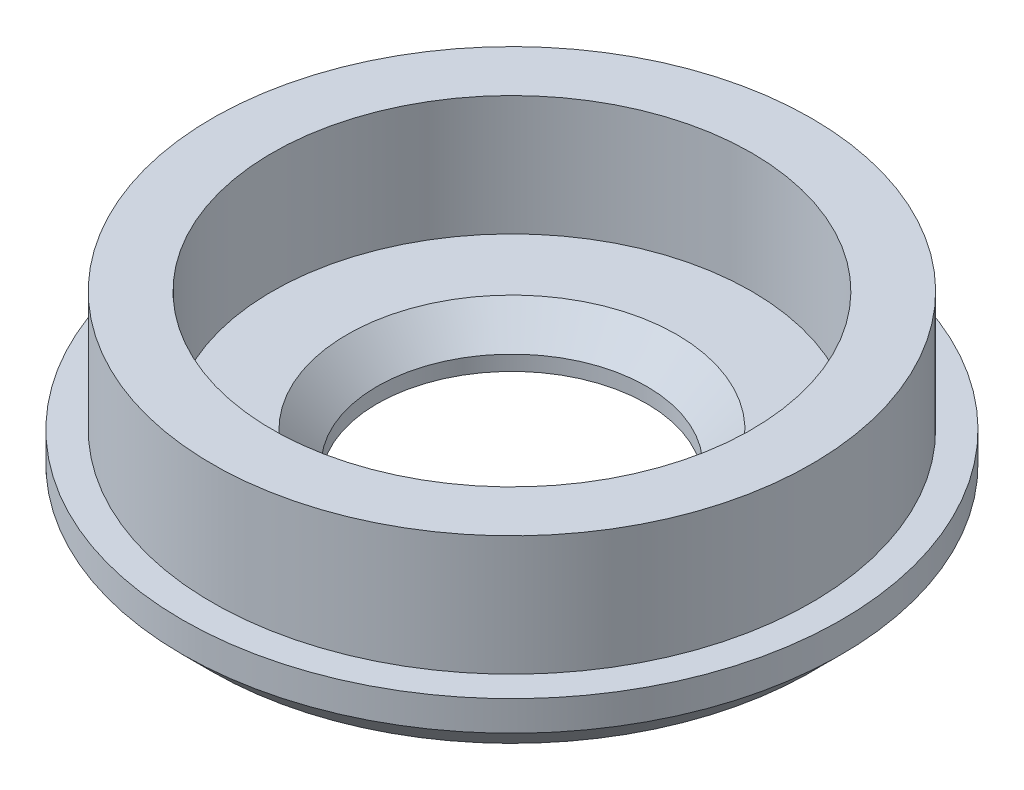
ISO-10303-21;
HEADER;
FILE_DESCRIPTION(('STEP AP214'),'2;1');
FILE_NAME('part.step','',(''),(''),'','','');
FILE_SCHEMA(('AUTOMOTIVE_DESIGN { 1 0 10303 214 1 1 1 1 }'));
ENDSEC;
DATA;
#1=APPLICATION_CONTEXT('core data for automotive mechanical design processes');
#2=APPLICATION_PROTOCOL_DEFINITION('international standard','automotive_design',2000,#1);
#3=PRODUCT_CONTEXT('',#1,'mechanical');
#4=PRODUCT('Part','Part','',(#3));
#5=PRODUCT_RELATED_PRODUCT_CATEGORY('part','',(#4));
#6=PRODUCT_DEFINITION_FORMATION('','',#4);
#7=PRODUCT_DEFINITION_CONTEXT('part definition',#1,'design');
#8=PRODUCT_DEFINITION('design','',#6,#7);
#9=PRODUCT_DEFINITION_SHAPE('','',#8);
#10=(LENGTH_UNIT() NAMED_UNIT(*) SI_UNIT(.MILLI.,.METRE.));
#11=(NAMED_UNIT(*) PLANE_ANGLE_UNIT() SI_UNIT($,.RADIAN.));
#12=(NAMED_UNIT(*) SI_UNIT($,.STERADIAN.) SOLID_ANGLE_UNIT());
#13=UNCERTAINTY_MEASURE_WITH_UNIT(LENGTH_MEASURE(1.E-05),#10,'distance_accuracy_value','');
#14=(GEOMETRIC_REPRESENTATION_CONTEXT(3) GLOBAL_UNCERTAINTY_ASSIGNED_CONTEXT((#13)) GLOBAL_UNIT_ASSIGNED_CONTEXT((#10,
#11,#12)) REPRESENTATION_CONTEXT('',''));
#15=CARTESIAN_POINT('',(0.,0.,0.));
#16=DIRECTION('',(0.,0.,1.));
#17=DIRECTION('',(1.,0.,0.));
#18=AXIS2_PLACEMENT_3D('',#15,#16,#17);
#19=CARTESIAN_POINT('',(0.,0.,0.));
#20=DIRECTION('',(0.,1.,0.));
#21=DIRECTION('',(0.,0.,1.));
#22=AXIS2_PLACEMENT_3D('',#19,#20,#21);
#23=PLANE('',#22);
#24=CARTESIAN_POINT('',(0.,0.,0.));
#25=DIRECTION('',(0.,-1.,0.));
#26=DIRECTION('',(0.,0.,-1.));
#27=AXIS2_PLACEMENT_3D('',#24,#25,#26);
#28=CIRCLE('',#27,8.);
#29=CARTESIAN_POINT('',(0.,0.,-8.));
#30=VERTEX_POINT('',#29);
#31=EDGE_CURVE('E151',#30,#30,#28,.F.);
#32=ORIENTED_EDGE('',*,*,#31,.T.);
#33=EDGE_LOOP('',(#32));
#34=FACE_BOUND('',#33,.T.);
#35=CARTESIAN_POINT('',(0.,5.6843418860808E-11,0.));
#36=DIRECTION('',(0.,1.,0.));
#37=DIRECTION('',(0.,0.,1.));
#38=AXIS2_PLACEMENT_3D('',#35,#36,#37);
#39=CIRCLE('',#38,5.49999999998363);
#40=CARTESIAN_POINT('',(0.,5.6843418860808E-11,5.49999999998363));
#41=VERTEX_POINT('',#40);
#42=EDGE_CURVE('E154',#41,#41,#39,.F.);
#43=ORIENTED_EDGE('',*,*,#42,.T.);
#44=EDGE_LOOP('',(#43));
#45=FACE_BOUND('',#44,.T.);
#46=ADVANCED_FACE('F17',(#34,#45),#23,.T.);
#47=CARTESIAN_POINT('',(0.,4.,0.));
#48=DIRECTION('',(0.,-1.,0.));
#49=DIRECTION('',(0.,0.,-1.));
#50=AXIS2_PLACEMENT_3D('',#47,#48,#49);
#51=CYLINDRICAL_SURFACE('',#50,8.);
#52=CARTESIAN_POINT('',(0.,4.,0.));
#53=DIRECTION('',(0.,-1.,0.));
#54=DIRECTION('',(0.,0.,-1.));
#55=AXIS2_PLACEMENT_3D('',#52,#53,#54);
#56=CIRCLE('',#55,8.);
#57=CARTESIAN_POINT('',(0.,4.,-8.));
#58=VERTEX_POINT('',#57);
#59=EDGE_CURVE('E157',#58,#58,#56,.T.);
#60=ORIENTED_EDGE('',*,*,#59,.F.);
#61=EDGE_LOOP('',(#60));
#62=FACE_BOUND('',#61,.T.);
#63=ORIENTED_EDGE('',*,*,#31,.F.);
#64=EDGE_LOOP('',(#63));
#65=FACE_BOUND('',#64,.T.);
#66=ADVANCED_FACE('F90',(#62,#65),#51,.F.);
#67=CARTESIAN_POINT('',(0.,5.6843418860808E-11,0.));
#68=DIRECTION('',(0.,1.,0.));
#69=DIRECTION('',(0.,0.,1.));
#70=AXIS2_PLACEMENT_3D('',#67,#68,#69);
#71=CONICAL_SURFACE('',#70,5.49999999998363,0.785398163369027);
#72=ORIENTED_EDGE('',*,*,#42,.F.);
#73=EDGE_LOOP('',(#72));
#74=FACE_BOUND('',#73,.T.);
#75=CARTESIAN_POINT('',(0.,-1.00000000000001,0.));
#76=DIRECTION('',(0.,1.,0.));
#77=DIRECTION('',(0.,0.,1.));
#78=AXIS2_PLACEMENT_3D('',#75,#76,#77);
#79=CIRCLE('',#78,4.5);
#80=CARTESIAN_POINT('',(0.,-1.00000000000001,4.5));
#81=VERTEX_POINT('',#80);
#82=EDGE_CURVE('E160',#81,#81,#79,.F.);
#83=ORIENTED_EDGE('',*,*,#82,.T.);
#84=EDGE_LOOP('',(#83));
#85=FACE_BOUND('',#84,.T.);
#86=ADVANCED_FACE('F87',(#74,#85),#71,.F.);
#87=CARTESIAN_POINT('',(0.,4.,0.));
#88=DIRECTION('',(0.,1.,0.));
#89=DIRECTION('',(0.,0.,1.));
#90=AXIS2_PLACEMENT_3D('',#87,#88,#89);
#91=PLANE('',#90);
#92=ORIENTED_EDGE('',*,*,#59,.T.);
#93=EDGE_LOOP('',(#92));
#94=FACE_BOUND('',#93,.T.);
#95=CARTESIAN_POINT('',(0.,4.,0.));
#96=DIRECTION('',(0.,-1.,0.));
#97=DIRECTION('',(0.,0.,-1.));
#98=AXIS2_PLACEMENT_3D('',#95,#96,#97);
#99=CIRCLE('',#98,10.);
#100=CARTESIAN_POINT('',(0.,4.,-10.));
#101=VERTEX_POINT('',#100);
#102=EDGE_CURVE('E161',#101,#101,#99,.T.);
#103=ORIENTED_EDGE('',*,*,#102,.F.);
#104=EDGE_LOOP('',(#103));
#105=FACE_BOUND('',#104,.T.);
#106=ADVANCED_FACE('F83',(#94,#105),#91,.T.);
#107=CARTESIAN_POINT('',(0.,-2.,0.));
#108=DIRECTION('',(0.,1.,0.));
#109=DIRECTION('',(0.,0.,1.));
#110=AXIS2_PLACEMENT_3D('',#107,#108,#109);
#111=CYLINDRICAL_SURFACE('',#110,4.5);
#112=ORIENTED_EDGE('',*,*,#82,.F.);
#113=EDGE_LOOP('',(#112));
#114=FACE_BOUND('',#113,.T.);
#115=CARTESIAN_POINT('',(0.,-1.5,0.));
#116=DIRECTION('',(0.,1.,0.));
#117=DIRECTION('',(0.,0.,1.));
#118=AXIS2_PLACEMENT_3D('',#115,#116,#117);
#119=CIRCLE('',#118,4.5);
#120=CARTESIAN_POINT('',(0.,-1.5,4.5));
#121=VERTEX_POINT('',#120);
#122=EDGE_CURVE('E164',#121,#121,#119,.T.);
#123=ORIENTED_EDGE('',*,*,#122,.F.);
#124=EDGE_LOOP('',(#123));
#125=FACE_BOUND('',#124,.T.);
#126=ADVANCED_FACE('F79',(#114,#125),#111,.F.);
#127=CARTESIAN_POINT('',(0.,4.,0.));
#128=DIRECTION('',(0.,-1.,0.));
#129=DIRECTION('',(0.,0.,-1.));
#130=AXIS2_PLACEMENT_3D('',#127,#128,#129);
#131=CYLINDRICAL_SURFACE('',#130,10.);
#132=CARTESIAN_POINT('',(0.,0.,0.));
#133=DIRECTION('',(0.,-1.,0.));
#134=DIRECTION('',(0.,0.,-1.));
#135=AXIS2_PLACEMENT_3D('',#132,#133,#134);
#136=CIRCLE('',#135,10.);
#137=CARTESIAN_POINT('',(0.,0.,-10.));
#138=VERTEX_POINT('',#137);
#139=EDGE_CURVE('E51',#138,#138,#136,.T.);
#140=ORIENTED_EDGE('',*,*,#139,.F.);
#141=EDGE_LOOP('',(#140));
#142=FACE_BOUND('',#141,.T.);
#143=ORIENTED_EDGE('',*,*,#102,.T.);
#144=EDGE_LOOP('',(#143));
#145=FACE_BOUND('',#144,.T.);
#146=ADVANCED_FACE('F74',(#142,#145),#131,.T.);
#147=CARTESIAN_POINT('',(0.,-1.5,0.));
#148=DIRECTION('',(0.,-1.,0.));
#149=DIRECTION('',(0.,0.,-1.));
#150=AXIS2_PLACEMENT_3D('',#147,#148,#149);
#151=PLANE('',#150);
#152=ORIENTED_EDGE('',*,*,#122,.T.);
#153=EDGE_LOOP('',(#152));
#154=FACE_BOUND('',#153,.T.);
#155=CARTESIAN_POINT('',(0.,-1.5,0.));
#156=DIRECTION('',(0.,1.,0.));
#157=DIRECTION('',(0.,0.,-1.));
#158=AXIS2_PLACEMENT_3D('',#155,#156,#157);
#159=CIRCLE('',#158,4.82055052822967);
#160=CARTESIAN_POINT('',(0.,-1.5,4.82055052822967));
#161=VERTEX_POINT('',#160);
#162=CARTESIAN_POINT('',(0.,-1.5,-4.82055052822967));
#163=VERTEX_POINT('',#162);
#164=EDGE_CURVE('E47',#161,#163,#159,.F.);
#165=ORIENTED_EDGE('',*,*,#164,.T.);
#166=CARTESIAN_POINT('',(0.,-1.5,0.));
#167=DIRECTION('',(0.,1.,0.));
#168=DIRECTION('',(0.,0.,1.));
#169=AXIS2_PLACEMENT_3D('',#166,#167,#168);
#170=CIRCLE('',#169,4.82055052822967);
#171=EDGE_CURVE('E44',#163,#161,#170,.F.);
#172=ORIENTED_EDGE('',*,*,#171,.T.);
#173=EDGE_LOOP('',(#165,#172));
#174=FACE_BOUND('',#173,.T.);
#175=ADVANCED_FACE('F54',(#154,#174),#151,.T.);
#176=CARTESIAN_POINT('',(0.,0.,0.));
#177=DIRECTION('',(0.,1.,0.));
#178=DIRECTION('',(0.,0.,1.));
#179=AXIS2_PLACEMENT_3D('',#176,#177,#178);
#180=PLANE('',#179);
#181=ORIENTED_EDGE('',*,*,#139,.T.);
#182=EDGE_LOOP('',(#181));
#183=FACE_BOUND('',#182,.T.);
#184=CARTESIAN_POINT('',(0.,0.,0.));
#185=DIRECTION('',(0.,1.,0.));
#186=DIRECTION('',(0.,0.,1.));
#187=AXIS2_PLACEMENT_3D('',#184,#185,#186);
#188=CIRCLE('',#187,11.);
#189=CARTESIAN_POINT('',(0.,0.,11.));
#190=VERTEX_POINT('',#189);
#191=EDGE_CURVE('E55',#190,#190,#188,.F.);
#192=ORIENTED_EDGE('',*,*,#191,.F.);
#193=EDGE_LOOP('',(#192));
#194=FACE_BOUND('',#193,.T.);
#195=ADVANCED_FACE('F73',(#183,#194),#180,.T.);
#196=CARTESIAN_POINT('',(0.,-6.5,4.82055052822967));
#197=DIRECTION('',(1.,0.,0.));
#198=DIRECTION('',(0.,0.,1.));
#199=AXIS2_PLACEMENT_3D('',#196,#197,#198);
#200=CIRCLE('',#199,5.);
#201=TRIMMED_CURVE('',#200,(PARAMETER_VALUE(-2.87286731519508)),
(PARAMETER_VALUE(2.87286731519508)),.T.,.PARAMETER.);
#202=CARTESIAN_POINT('',(0.,-6.5,0.));
#203=DIRECTION('',(0.,1.,0.));
#204=AXIS1_PLACEMENT('',#202,#203);
#205=SURFACE_OF_REVOLUTION('',#201,#204);
#206=CARTESIAN_POINT('',(0.,-1.91666666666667,0.));
#207=DIRECTION('',(0.,1.,0.));
#208=DIRECTION('',(0.,0.,1.));
#209=AXIS2_PLACEMENT_3D('',#206,#207,#208);
#210=CIRCLE('',#209,6.8188136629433);
#211=CARTESIAN_POINT('',(0.,-1.91666666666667,6.8188136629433));
#212=VERTEX_POINT('',#211);
#213=EDGE_CURVE('E170',#212,#212,#210,.T.);
#214=ORIENTED_EDGE('',*,*,#213,.F.);
#215=EDGE_LOOP('',(#214));
#216=FACE_BOUND('',#215,.T.);
#217=ORIENTED_EDGE('',*,*,#164,.F.);
#218=ORIENTED_EDGE('',*,*,#171,.F.);
#219=EDGE_LOOP('',(#217,#218));
#220=FACE_BOUND('',#219,.T.);
#221=ADVANCED_FACE('F48',(#216,#220),#205,.T.);
#222=CARTESIAN_POINT('',(0.,-2.,0.));
#223=DIRECTION('',(0.,1.,0.));
#224=DIRECTION('',(0.,0.,1.));
#225=AXIS2_PLACEMENT_3D('',#222,#223,#224);
#226=CYLINDRICAL_SURFACE('',#225,11.);
#227=CARTESIAN_POINT('',(0.,-0.999999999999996,0.));
#228=DIRECTION('',(0.,1.,0.));
#229=DIRECTION('',(0.,0.,1.));
#230=AXIS2_PLACEMENT_3D('',#227,#228,#229);
#231=CIRCLE('',#230,11.);
#232=CARTESIAN_POINT('',(0.,-0.999999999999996,11.));
#233=VERTEX_POINT('',#232);
#234=EDGE_CURVE('E188',#233,#233,#231,.F.);
#235=ORIENTED_EDGE('',*,*,#234,.F.);
#236=EDGE_LOOP('',(#235));
#237=FACE_BOUND('',#236,.T.);
#238=ORIENTED_EDGE('',*,*,#191,.T.);
#239=EDGE_LOOP('',(#238));
#240=FACE_BOUND('',#239,.T.);
#241=ADVANCED_FACE('F135',(#237,#240),#226,.T.);
#242=CARTESIAN_POINT('',(0.,-1.,0.));
#243=DIRECTION('',(0.,1.,0.));
#244=DIRECTION('',(0.,0.,1.));
#245=AXIS2_PLACEMENT_3D('',#242,#243,#244);
#246=TOROIDAL_SURFACE('',#245,7.21846628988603,1.);
#247=CARTESIAN_POINT('',(0.,-2.,0.));
#248=DIRECTION('',(0.,-1.,0.));
#249=DIRECTION('',(0.,0.,1.));
#250=AXIS2_PLACEMENT_3D('',#247,#248,#249);
#251=CIRCLE('',#250,7.21846628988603);
#252=CARTESIAN_POINT('',(0.,-2.,7.21846628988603));
#253=VERTEX_POINT('',#252);
#254=CARTESIAN_POINT('',(0.,-2.,-7.21846628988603));
#255=VERTEX_POINT('',#254);
#256=EDGE_CURVE('E150',#253,#255,#251,.T.);
#257=ORIENTED_EDGE('',*,*,#256,.T.);
#258=CARTESIAN_POINT('',(0.,-2.,0.));
#259=DIRECTION('',(0.,-1.,0.));
#260=DIRECTION('',(0.,0.,-1.));
#261=AXIS2_PLACEMENT_3D('',#258,#259,#260);
#262=CIRCLE('',#261,7.21846628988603);
#263=EDGE_CURVE('E28',#255,#253,#262,.T.);
#264=ORIENTED_EDGE('',*,*,#263,.T.);
#265=EDGE_LOOP('',(#257,#264));
#266=FACE_BOUND('',#265,.T.);
#267=ORIENTED_EDGE('',*,*,#213,.T.);
#268=EDGE_LOOP('',(#267));
#269=FACE_BOUND('',#268,.T.);
#270=ADVANCED_FACE('F109',(#266,#269),#246,.T.);
#271=CARTESIAN_POINT('',(0.,-0.999999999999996,0.));
#272=DIRECTION('',(0.,1.,0.));
#273=DIRECTION('',(0.,0.,1.));
#274=AXIS2_PLACEMENT_3D('',#271,#272,#273);
#275=CONICAL_SURFACE('',#274,11.,0.785398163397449);
#276=CARTESIAN_POINT('',(0.,-2.,0.));
#277=DIRECTION('',(0.,1.,0.));
#278=DIRECTION('',(0.,0.,1.));
#279=AXIS2_PLACEMENT_3D('',#276,#277,#278);
#280=CIRCLE('',#279,9.99999999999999);
#281=CARTESIAN_POINT('',(0.,-2.,9.99999999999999));
#282=VERTEX_POINT('',#281);
#283=EDGE_CURVE('E11',#282,#282,#280,.T.);
#284=ORIENTED_EDGE('',*,*,#283,.T.);
#285=EDGE_LOOP('',(#284));
#286=FACE_BOUND('',#285,.T.);
#287=ORIENTED_EDGE('',*,*,#234,.T.);
#288=EDGE_LOOP('',(#287));
#289=FACE_BOUND('',#288,.T.);
#290=ADVANCED_FACE('F103',(#286,#289),#275,.T.);
#291=CARTESIAN_POINT('',(0.,-2.,0.));
#292=DIRECTION('',(0.,1.,0.));
#293=DIRECTION('',(0.,0.,1.));
#294=AXIS2_PLACEMENT_3D('',#291,#292,#293);
#295=PLANE('',#294);
#296=ORIENTED_EDGE('',*,*,#283,.F.);
#297=EDGE_LOOP('',(#296));
#298=FACE_BOUND('',#297,.T.);
#299=ORIENTED_EDGE('',*,*,#256,.F.);
#300=ORIENTED_EDGE('',*,*,#263,.F.);
#301=EDGE_LOOP('',(#299,#300));
#302=FACE_BOUND('',#301,.T.);
#303=ADVANCED_FACE('F101',(#298,#302),#295,.F.);
#304=CLOSED_SHELL('',(#46,#66,#86,#106,#126,#146,#175,#195,#221,#241,#270,#290,#303));
#305=MANIFOLD_SOLID_BREP('B1',#304);
#306=ADVANCED_BREP_SHAPE_REPRESENTATION('',(#18,#305),#14);
#307=SHAPE_DEFINITION_REPRESENTATION(#9,#306);
ENDSEC;
END-ISO-10303-21;
